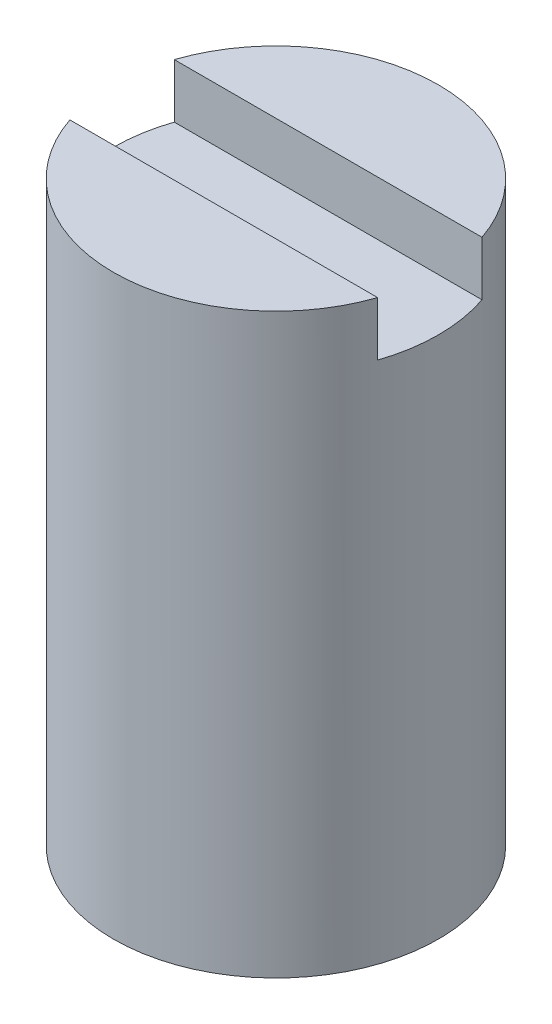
from build123d import *

# Parameters (mm, degrees)
SKETCH1_R                   = 9.525
BOSS_EXTRUDE1_DEPTH         = 33.854898
SKETCH2_W                   = 25.4
SKETCH2_H                   = 6.1214
CUT_EXTRUDE1_DEPTH          = 3.175
F_1_4_20_TAPPED_HOLE1_D     = 5.1054
F_1_4_20_TAPPED_HOLE1_DEPTH = 12.7
F_1_4_20_TAPPED_HOLE1_TIP   = 1.533816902


with BuildPart() as part:
    # Sketch1 → Boss-Extrude1 (new body)
    with BuildSketch(Plane(origin=(0, 0, 0), x_dir=(1, 0, 0), z_dir=(0, 1, 0))):
        with Locations(Location((0, 0, 0), (0, 0, 270))):
            Circle(SKETCH1_R)
    extrude(amount=BOSS_EXTRUDE1_DEPTH)

    # Sketch2 → Cut-Extrude1 (cut)
    with BuildSketch(Plane(origin=(0, 33.854898, 0), x_dir=(1, 0, 0), z_dir=(0, 1, 0))):
        Rectangle(SKETCH2_W, SKETCH2_H)
    extrude(amount=-CUT_EXTRUDE1_DEPTH, mode=Mode.SUBTRACT)

    # 1_4-20 Tapped Hole1
    with Locations(Plane(origin=(0, 0, 0), x_dir=(-1, 0, 0), z_dir=(0, -1, 0))):
        with Locations((0, 0)):
            Hole(F_1_4_20_TAPPED_HOLE1_D / 2, depth=F_1_4_20_TAPPED_HOLE1_DEPTH)
            with Locations((0, 0, -(F_1_4_20_TAPPED_HOLE1_DEPTH + F_1_4_20_TAPPED_HOLE1_TIP / 2))):  # 118° drill point
                Cone(0, F_1_4_20_TAPPED_HOLE1_D / 2, F_1_4_20_TAPPED_HOLE1_TIP, mode=Mode.SUBTRACT)


solid = part.part
